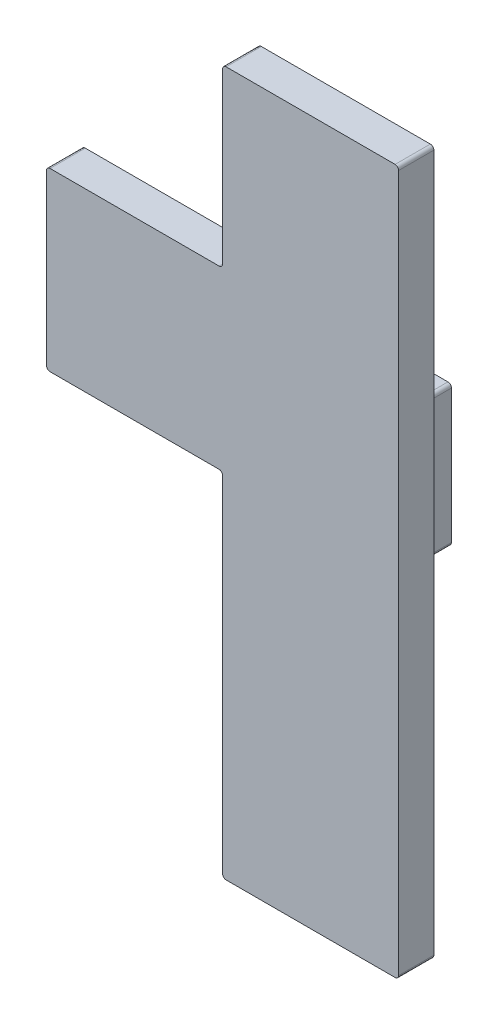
from build123d import *

# Parameters (mm, degrees)
AUFSATZ_LINEAR_AUSTRAGEN1_DEPTH = 5
SCHNITT_LINEAR_START            = -0.8
SKIZZE2_R                       = 2.7
SCHNITT_LINEAR_AUSTRAGEN1_DEPTH = 2.9
VERRUNDUNG1_R                   = 0.5
SKIZZE3_W                       = 6
SKIZZE3_H                       = 20
AUFSATZ_LINEAR_AUSTRAGEN2_DEPTH = 12
VERRUNDUNG2_R                   = 1.5
VERRUNDUNG3_R                   = 0.5


with BuildPart() as part:
    # Skizze1 → Aufsatz-Linear austragen1 (new body)
    with BuildSketch(Plane.XY):
        Polygon((0, 0), (0, 50), (-25, 50), (-25, 75), (0, 75), (0, 100), (25, 100), (25, 0), align=None)
    extrude(amount=AUFSATZ_LINEAR_AUSTRAGEN1_DEPTH)

    # Skizze2 → Schnitt-Linear austragen1 (cut)
    with BuildSketch(Plane.XY.offset(5).offset(SCHNITT_LINEAR_START)):
        with Locations((12.5, 87.5)):
            Circle(SKIZZE2_R)
    extrude(amount=-SCHNITT_LINEAR_AUSTRAGEN1_DEPTH, mode=Mode.SUBTRACT)

    # Verrundung1
    verrundung1_edges = [part.edges().sort_by_distance(p)[0] for p in [
        (0, 0, 2.5),
        (0, 50, 2.5),
        (-25, 50, 2.5),
        (-25, 75, 2.5),
        (0, 75, 2.5),
        (0, 100, 2.5),
        (25, 100, 2.5),
        (25, 0, 2.5),
    ]]
    fillet(verrundung1_edges, radius=VERRUNDUNG1_R)

    # Skizze3 → Aufsatz-Linear austragen2 (add)
    with BuildSketch(Plane(origin=(0, 0, 0), x_dir=(-1, 0, 0), z_dir=(0, 0, -1))):
        with Locations((-12.5, 50)):
            Rectangle(SKIZZE3_W, SKIZZE3_H)
    extrude(amount=AUFSATZ_LINEAR_AUSTRAGEN2_DEPTH)

    # Verrundung2
    verrundung2_edges = [part.edges().sort_by_distance(p)[0] for p in [
        (15.5, 50, 0),
        (12.5, 40, 0),
        (9.5, 50, 0),
        (12.5, 60, 0),
    ]]
    fillet(verrundung2_edges, radius=VERRUNDUNG2_R)

    # Verrundung3
    verrundung3_edges = [part.edges().sort_by_distance(p)[0] for p in [
        (8.969073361, 39.469073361, -0.355055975),
        (16.030926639, 39.469073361, -0.355055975),
        (8.969073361, 60.530926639, -0.355055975),
        (16.030926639, 60.530926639, -0.355055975),
        (15.5, 60, -6.75),
        (15.5, 40, -6.75),
        (9.5, 40, -6.75),
        (9.5, 60, -6.75),
    ]]
    fillet(verrundung3_edges, radius=VERRUNDUNG3_R)


solid = part.part
